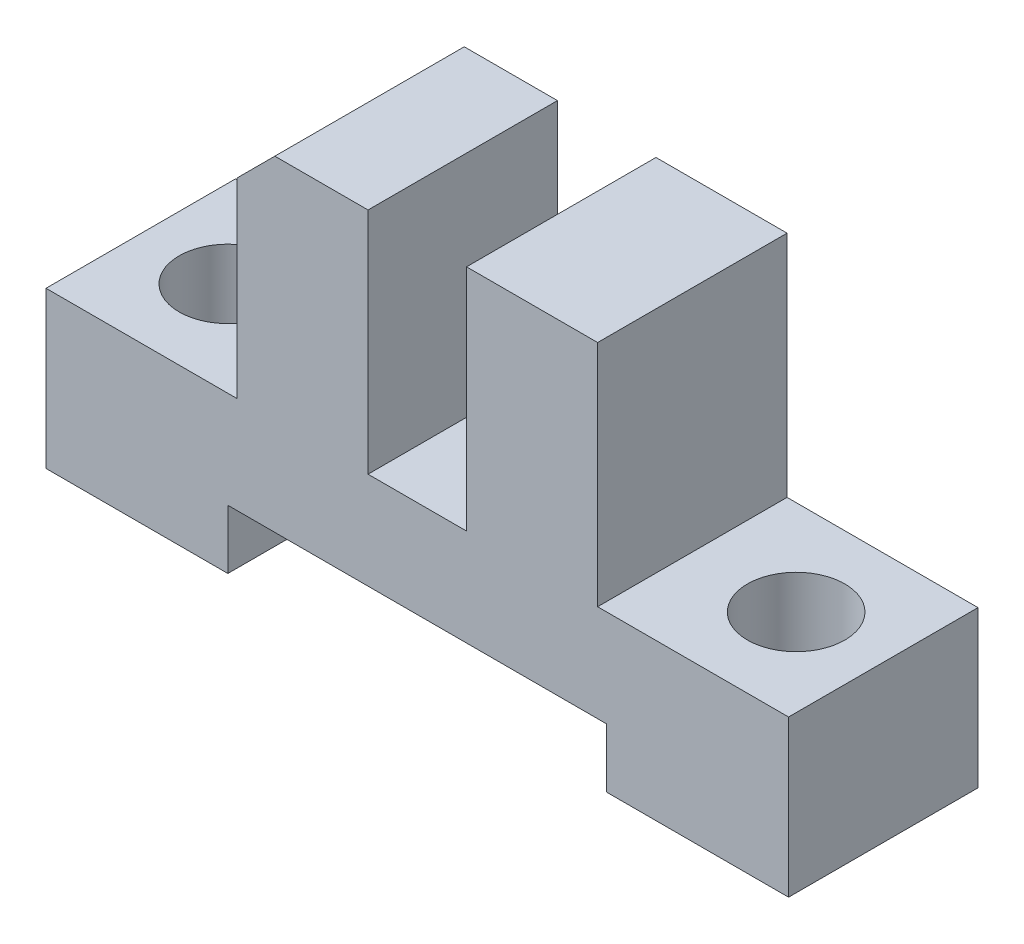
from build123d import *

# Parameters (mm, degrees)
EXTRUDE1_DEPTH                 = 6.35
CHAMFER1_SIZE                  = 1.27
F_30_0_128500_DIAMETER_HOLE1_D = 3.2639


with BuildPart() as part:
    # Sketch1 → Extrude1 (new body)
    with BuildSketch(Plane.XY):
        Polygon((1.651, 12.9032), (1.651, 5.2324), (-1.651, 5.2324), (-1.651, 12.9032), (-6.0452, 12.9032), (-6.0452, 5.2324), (-12.446, 5.2324), (-12.446, 0), (-6.35, 0), (-6.35, 1.9812), (6.35, 1.9812), (6.35, 0), (12.446, 0), (12.446, 5.2324), (6.0452, 5.2324), (6.0452, 12.9032), align=None)
    extrude(amount=EXTRUDE1_DEPTH)

    # Chamfer1
    chamfer1_edges = [part.edges().sort_by_distance(p)[0] for p in [
        (-6.0452, 12.9032, 3.175),
    ]]
    chamfer(chamfer1_edges, length=CHAMFER1_SIZE)

    # 30 _0.128500_ Diameter Hole1 (through all)
    with Locations(Plane(origin=(0, 5.2324, 0), x_dir=(-1, 0, 0), z_dir=(0, 1, 0))):
        with Locations((9.525, 3.175), (-9.525, 3.175)):
            Hole(F_30_0_128500_DIAMETER_HOLE1_D / 2)


solid = part.part
